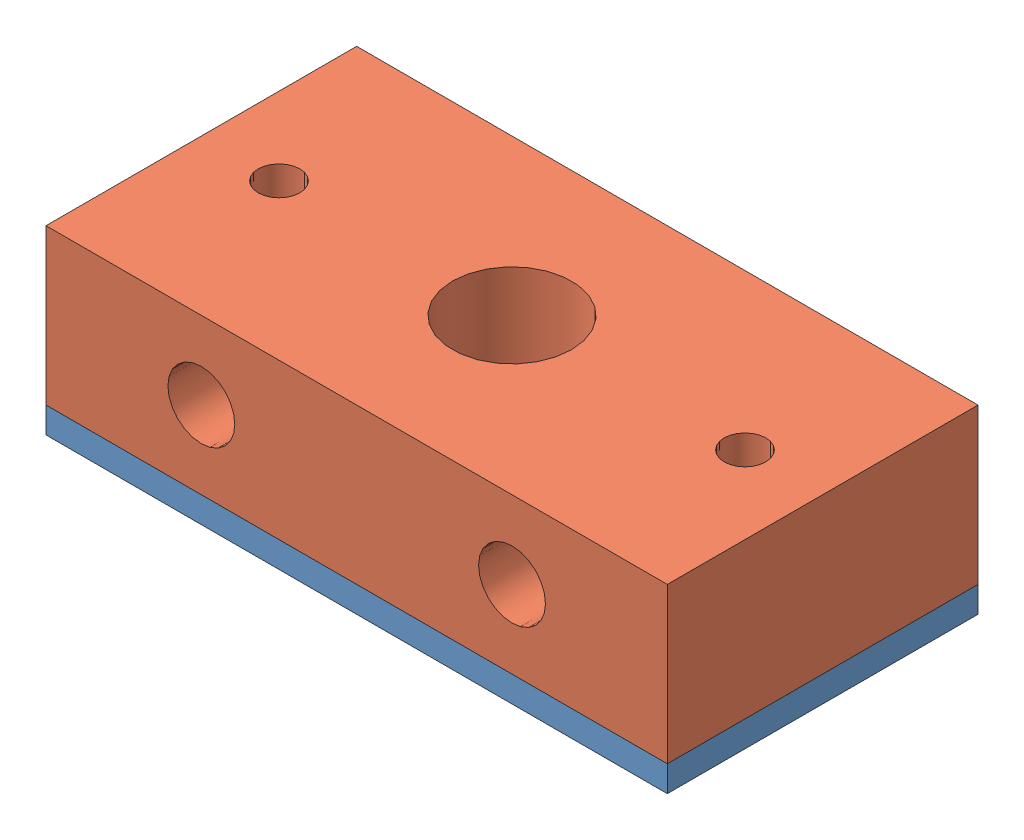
SolidWorks assembly CRP103-00.SLDASM, configuration Default (file format 5000). Lengths in mm.
Overall size (76.2 22.22 38.1).
3 component instances, 3 part files, 5 mates.
Components (placement in the parent):
- CRP103-02-1: CRP103-02.SLDPRT [BOM] at (-36.7376 -0.7135 17.7373) size (76.2 3.17 38.1)
- CRP103-01-1: CRP103-01.SLDPRT [BOM] at (-36.7376 21.5115 -20.3627) x (1 0 0) z (0 -1 0) size (76.2 38.1 19.05)
- Radial_Bearing-1: Radial_Bearing.SLDPRT [Default] at (1.3624 10.399 -1.3127) x (1 0 0) z (0 -1 0) size (28.57 28.57 7.94)
Mates (geometry in assembly coordinates):
- Coincident1: coincident anti-aligned: plane of CRP103-01-1 through (1.3624 10.399 -1.3127) normal (0 -1 0); plane of Radial_Bearing-1 through (1.3624 10.399 -1.3127) normal (0 1 0)
- Concentric1: concentric anti-aligned: cylinder of CRP103-01-1 through (1.3624 10.399 -1.3127) axis (0 -1 0) radius 14.3002; cylinder of Radial_Bearing-1 through (1.3624 2.4615 -1.3127) axis (0 1 0) radius 14.2875
- Coincident2: coincident anti-aligned: plane of CRP103-02-1 through (-36.7376 2.4615 -20.3627) normal (0 1 0); plane of CRP103-01-1 through (-36.7376 2.4615 17.7373) normal (0 -1 0)
- Coincident3: coincident aligned: plane of CRP103-02-1 through (-36.7376 2.4615 17.7373) normal (0 0 1); plane of CRP103-01-1 through (-36.7376 2.4615 17.7373) normal (0 0 1)
- Coincident4: coincident aligned: plane of CRP103-02-1 through (39.4624 2.4615 17.7373) normal (1 0 0); plane of CRP103-01-1 through (39.4624 2.4615 -20.3627) normal (1 0 0)
